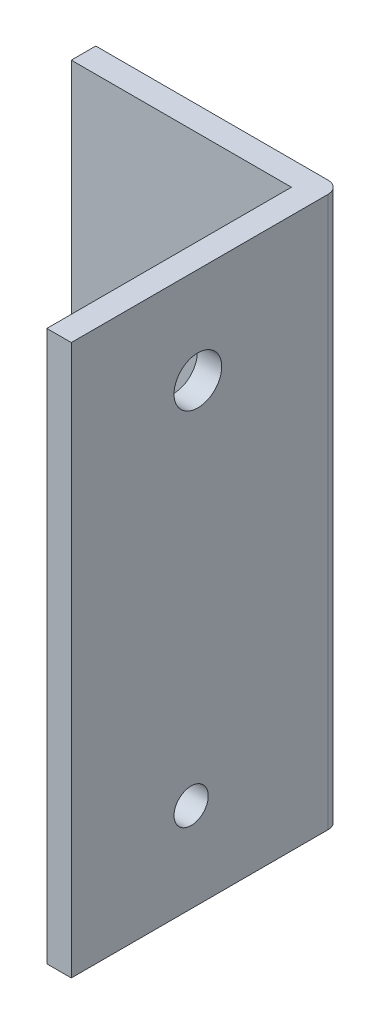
ISO-10303-21;
HEADER;
FILE_DESCRIPTION(('STEP AP214'),'2;1');
FILE_NAME('part.step','',(''),(''),'','','');
FILE_SCHEMA(('AUTOMOTIVE_DESIGN { 1 0 10303 214 1 1 1 1 }'));
ENDSEC;
DATA;
#1=APPLICATION_CONTEXT('core data for automotive mechanical design processes');
#2=APPLICATION_PROTOCOL_DEFINITION('international standard','automotive_design',2000,#1);
#3=PRODUCT_CONTEXT('',#1,'mechanical');
#4=PRODUCT('Part','Part','',(#3));
#5=PRODUCT_RELATED_PRODUCT_CATEGORY('part','',(#4));
#6=PRODUCT_DEFINITION_FORMATION('','',#4);
#7=PRODUCT_DEFINITION_CONTEXT('part definition',#1,'design');
#8=PRODUCT_DEFINITION('design','',#6,#7);
#9=PRODUCT_DEFINITION_SHAPE('','',#8);
#10=(LENGTH_UNIT() NAMED_UNIT(*) SI_UNIT(.MILLI.,.METRE.));
#11=(NAMED_UNIT(*) PLANE_ANGLE_UNIT() SI_UNIT($,.RADIAN.));
#12=(NAMED_UNIT(*) SI_UNIT($,.STERADIAN.) SOLID_ANGLE_UNIT());
#13=UNCERTAINTY_MEASURE_WITH_UNIT(LENGTH_MEASURE(1.E-05),#10,'distance_accuracy_value','');
#14=(GEOMETRIC_REPRESENTATION_CONTEXT(3) GLOBAL_UNCERTAINTY_ASSIGNED_CONTEXT((#13)) GLOBAL_UNIT_ASSIGNED_CONTEXT((#10,
#11,#12)) REPRESENTATION_CONTEXT('',''));
#15=CARTESIAN_POINT('',(0.,0.,0.));
#16=DIRECTION('',(0.,0.,1.));
#17=DIRECTION('',(1.,0.,0.));
#18=AXIS2_PLACEMENT_3D('',#15,#16,#17);
#19=CARTESIAN_POINT('',(25.4,-57.15,5.08));
#20=DIRECTION('',(-1.,0.,0.));
#21=DIRECTION('',(0.,0.,1.));
#22=AXIS2_PLACEMENT_3D('',#19,#20,#21);
#23=PLANE('',#22);
#24=CARTESIAN_POINT('',(25.4,37.211,29.591));
#25=DIRECTION('',(-1.,0.,0.));
#26=DIRECTION('',(0.,0.,1.));
#27=AXIS2_PLACEMENT_3D('',#24,#25,#26);
#28=CIRCLE('',#27,4.95299999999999);
#29=CARTESIAN_POINT('',(25.4,37.211,34.544));
#30=VERTEX_POINT('',#29);
#31=EDGE_CURVE('E120',#30,#30,#28,.T.);
#32=ORIENTED_EDGE('',*,*,#31,.T.);
#33=EDGE_LOOP('',(#32));
#34=FACE_BOUND('',#33,.T.);
#35=CARTESIAN_POINT('',(25.4,-38.608,30.988));
#36=DIRECTION('',(-1.,0.,0.));
#37=DIRECTION('',(0.,0.,1.));
#38=AXIS2_PLACEMENT_3D('',#35,#36,#37);
#39=CIRCLE('',#38,3.55600000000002);
#40=CARTESIAN_POINT('',(25.4,-38.608,34.544));
#41=VERTEX_POINT('',#40);
#42=EDGE_CURVE('E271',#41,#41,#39,.T.);
#43=ORIENTED_EDGE('',*,*,#42,.T.);
#44=EDGE_LOOP('',(#43));
#45=FACE_BOUND('',#44,.T.);
#46=DIRECTION('',(0.,0.,-1.));
#47=VECTOR('',#46,1.);
#48=CARTESIAN_POINT('',(25.4,-57.15,5.08));
#49=LINE('',#48,#47);
#50=CARTESIAN_POINT('',(25.4,-57.15,55.88));
#51=VERTEX_POINT('',#50);
#52=CARTESIAN_POINT('',(25.4,-57.15,2.54));
#53=VERTEX_POINT('',#52);
#54=EDGE_CURVE('E130',#51,#53,#49,.T.);
#55=ORIENTED_EDGE('',*,*,#54,.T.);
#56=DIRECTION('',(0.,1.,0.));
#57=VECTOR('',#56,1.);
#58=CARTESIAN_POINT('',(25.4,57.15,2.54));
#59=LINE('',#58,#57);
#60=CARTESIAN_POINT('',(25.4,57.15,2.54));
#61=VERTEX_POINT('',#60);
#62=EDGE_CURVE('E145',#53,#61,#59,.T.);
#63=ORIENTED_EDGE('',*,*,#62,.T.);
#64=DIRECTION('',(0.,0.,-1.));
#65=VECTOR('',#64,1.);
#66=CARTESIAN_POINT('',(25.4,57.15,5.08));
#67=LINE('',#66,#65);
#68=CARTESIAN_POINT('',(25.4,57.15,55.88));
#69=VERTEX_POINT('',#68);
#70=EDGE_CURVE('E143',#69,#61,#67,.T.);
#71=ORIENTED_EDGE('',*,*,#70,.F.);
#72=DIRECTION('',(0.,-1.,0.));
#73=VECTOR('',#72,1.);
#74=CARTESIAN_POINT('',(25.4,57.15,55.88));
#75=LINE('',#74,#73);
#76=EDGE_CURVE('E98',#69,#51,#75,.T.);
#77=ORIENTED_EDGE('',*,*,#76,.T.);
#78=EDGE_LOOP('',(#55,#63,#71,#77));
#79=FACE_BOUND('',#78,.T.);
#80=ADVANCED_FACE('F32',(#34,#45,#79),#23,.F.);
#81=CARTESIAN_POINT('',(-25.4,57.15,5.08));
#82=DIRECTION('',(0.,-1.,0.));
#83=DIRECTION('',(0.,0.,-1.));
#84=AXIS2_PLACEMENT_3D('',#81,#82,#83);
#85=PLANE('',#84);
#86=ORIENTED_EDGE('',*,*,#70,.T.);
#87=CARTESIAN_POINT('',(22.86,57.15,2.54));
#88=DIRECTION('',(0.,-1.,0.));
#89=DIRECTION('',(0.,0.,-1.));
#90=AXIS2_PLACEMENT_3D('',#87,#88,#89);
#91=CIRCLE('',#90,2.54);
#92=CARTESIAN_POINT('',(22.86,57.15,0.));
#93=VERTEX_POINT('',#92);
#94=EDGE_CURVE('E54',#61,#93,#91,.F.);
#95=ORIENTED_EDGE('',*,*,#94,.T.);
#96=DIRECTION('',(-1.,0.,0.));
#97=VECTOR('',#96,1.);
#98=CARTESIAN_POINT('',(-25.4,57.15,0.));
#99=LINE('',#98,#97);
#100=CARTESIAN_POINT('',(-25.4,57.15,0.));
#101=VERTEX_POINT('',#100);
#102=EDGE_CURVE('E121',#93,#101,#99,.T.);
#103=ORIENTED_EDGE('',*,*,#102,.T.);
#104=DIRECTION('',(0.,0.,-1.));
#105=VECTOR('',#104,1.);
#106=CARTESIAN_POINT('',(-25.4,57.15,5.08));
#107=LINE('',#106,#105);
#108=CARTESIAN_POINT('',(-25.4,57.15,5.08));
#109=VERTEX_POINT('',#108);
#110=EDGE_CURVE('E140',#109,#101,#107,.T.);
#111=ORIENTED_EDGE('',*,*,#110,.F.);
#112=DIRECTION('',(-1.,0.,0.));
#113=VECTOR('',#112,1.);
#114=CARTESIAN_POINT('',(-25.4,57.15,5.08));
#115=LINE('',#114,#113);
#116=CARTESIAN_POINT('',(20.32,57.15,5.08));
#117=VERTEX_POINT('',#116);
#118=EDGE_CURVE('E112',#117,#109,#115,.T.);
#119=ORIENTED_EDGE('',*,*,#118,.F.);
#120=DIRECTION('',(0.,0.,1.));
#121=VECTOR('',#120,1.);
#122=CARTESIAN_POINT('',(20.32,57.15,5.08));
#123=LINE('',#122,#121);
#124=CARTESIAN_POINT('',(20.32,57.15,55.88));
#125=VERTEX_POINT('',#124);
#126=EDGE_CURVE('E105',#117,#125,#123,.T.);
#127=ORIENTED_EDGE('',*,*,#126,.T.);
#128=DIRECTION('',(1.,0.,0.));
#129=VECTOR('',#128,1.);
#130=CARTESIAN_POINT('',(20.32,57.15,55.88));
#131=LINE('',#130,#129);
#132=EDGE_CURVE('E91',#125,#69,#131,.T.);
#133=ORIENTED_EDGE('',*,*,#132,.T.);
#134=EDGE_LOOP('',(#86,#95,#103,#111,#119,#127,#133));
#135=FACE_BOUND('',#134,.T.);
#136=ADVANCED_FACE('F110',(#135),#85,.F.);
#137=CARTESIAN_POINT('',(-25.4,-57.15,5.08));
#138=DIRECTION('',(1.,0.,0.));
#139=DIRECTION('',(0.,0.,-1.));
#140=AXIS2_PLACEMENT_3D('',#137,#138,#139);
#141=PLANE('',#140);
#142=DIRECTION('',(0.,-1.,0.));
#143=VECTOR('',#142,1.);
#144=CARTESIAN_POINT('',(-25.4,-57.15,0.));
#145=LINE('',#144,#143);
#146=CARTESIAN_POINT('',(-25.4,-57.15,0.));
#147=VERTEX_POINT('',#146);
#148=EDGE_CURVE('E132',#101,#147,#145,.T.);
#149=ORIENTED_EDGE('',*,*,#148,.T.);
#150=DIRECTION('',(0.,0.,-1.));
#151=VECTOR('',#150,1.);
#152=CARTESIAN_POINT('',(-25.4,-57.15,5.08));
#153=LINE('',#152,#151);
#154=CARTESIAN_POINT('',(-25.4,-57.15,5.08));
#155=VERTEX_POINT('',#154);
#156=EDGE_CURVE('E137',#155,#147,#153,.T.);
#157=ORIENTED_EDGE('',*,*,#156,.F.);
#158=DIRECTION('',(0.,-1.,0.));
#159=VECTOR('',#158,1.);
#160=CARTESIAN_POINT('',(-25.4,-57.15,5.08));
#161=LINE('',#160,#159);
#162=EDGE_CURVE('E124',#109,#155,#161,.T.);
#163=ORIENTED_EDGE('',*,*,#162,.F.);
#164=ORIENTED_EDGE('',*,*,#110,.T.);
#165=EDGE_LOOP('',(#149,#157,#163,#164));
#166=FACE_BOUND('',#165,.T.);
#167=ADVANCED_FACE('F159',(#166),#141,.F.);
#168=CARTESIAN_POINT('',(-25.4,-57.15,5.08));
#169=DIRECTION('',(0.,1.,0.));
#170=DIRECTION('',(0.,0.,1.));
#171=AXIS2_PLACEMENT_3D('',#168,#169,#170);
#172=PLANE('',#171);
#173=DIRECTION('',(1.,0.,0.));
#174=VECTOR('',#173,1.);
#175=CARTESIAN_POINT('',(-25.4,-57.15,0.));
#176=LINE('',#175,#174);
#177=CARTESIAN_POINT('',(22.86,-57.15,0.));
#178=VERTEX_POINT('',#177);
#179=EDGE_CURVE('E125',#147,#178,#176,.T.);
#180=ORIENTED_EDGE('',*,*,#179,.T.);
#181=CARTESIAN_POINT('',(22.86,-57.15,2.54));
#182=DIRECTION('',(0.,1.,0.));
#183=DIRECTION('',(0.,0.,1.));
#184=AXIS2_PLACEMENT_3D('',#181,#182,#183);
#185=CIRCLE('',#184,2.54);
#186=EDGE_CURVE('E11',#178,#53,#185,.F.);
#187=ORIENTED_EDGE('',*,*,#186,.T.);
#188=ORIENTED_EDGE('',*,*,#54,.F.);
#189=DIRECTION('',(1.,0.,0.));
#190=VECTOR('',#189,1.);
#191=CARTESIAN_POINT('',(20.32,-57.15,55.88));
#192=LINE('',#191,#190);
#193=CARTESIAN_POINT('',(20.32,-57.15,55.88));
#194=VERTEX_POINT('',#193);
#195=EDGE_CURVE('E100',#194,#51,#192,.T.);
#196=ORIENTED_EDGE('',*,*,#195,.F.);
#197=DIRECTION('',(0.,0.,-1.));
#198=VECTOR('',#197,1.);
#199=CARTESIAN_POINT('',(20.32,-57.15,55.88));
#200=LINE('',#199,#198);
#201=CARTESIAN_POINT('',(20.32,-57.15,5.08));
#202=VERTEX_POINT('',#201);
#203=EDGE_CURVE('E101',#194,#202,#200,.T.);
#204=ORIENTED_EDGE('',*,*,#203,.T.);
#205=DIRECTION('',(1.,0.,0.));
#206=VECTOR('',#205,1.);
#207=CARTESIAN_POINT('',(-25.4,-57.15,5.08));
#208=LINE('',#207,#206);
#209=EDGE_CURVE('E127',#155,#202,#208,.T.);
#210=ORIENTED_EDGE('',*,*,#209,.F.);
#211=ORIENTED_EDGE('',*,*,#156,.T.);
#212=EDGE_LOOP('',(#180,#187,#188,#196,#204,#210,#211));
#213=FACE_BOUND('',#212,.T.);
#214=ADVANCED_FACE('F153',(#213),#172,.F.);
#215=CARTESIAN_POINT('',(0.,0.,5.08));
#216=DIRECTION('',(0.,0.,-1.));
#217=DIRECTION('',(-1.,0.,0.));
#218=AXIS2_PLACEMENT_3D('',#215,#216,#217);
#219=PLANE('',#218);
#220=ORIENTED_EDGE('',*,*,#209,.T.);
#221=DIRECTION('',(0.,1.,0.));
#222=VECTOR('',#221,1.);
#223=CARTESIAN_POINT('',(20.32,-57.15,5.08));
#224=LINE('',#223,#222);
#225=EDGE_CURVE('E113',#202,#117,#224,.T.);
#226=ORIENTED_EDGE('',*,*,#225,.T.);
#227=ORIENTED_EDGE('',*,*,#118,.T.);
#228=ORIENTED_EDGE('',*,*,#162,.T.);
#229=EDGE_LOOP('',(#220,#226,#227,#228));
#230=FACE_BOUND('',#229,.T.);
#231=ADVANCED_FACE('F162',(#230),#219,.F.);
#232=CARTESIAN_POINT('',(0.,0.,0.));
#233=DIRECTION('',(0.,0.,-1.));
#234=DIRECTION('',(-1.,0.,0.));
#235=AXIS2_PLACEMENT_3D('',#232,#233,#234);
#236=PLANE('',#235);
#237=ORIENTED_EDGE('',*,*,#102,.F.);
#238=DIRECTION('',(0.,1.,0.));
#239=VECTOR('',#238,1.);
#240=CARTESIAN_POINT('',(22.86,-57.15,0.));
#241=LINE('',#240,#239);
#242=EDGE_CURVE('E40',#93,#178,#241,.F.);
#243=ORIENTED_EDGE('',*,*,#242,.T.);
#244=ORIENTED_EDGE('',*,*,#179,.F.);
#245=ORIENTED_EDGE('',*,*,#148,.F.);
#246=EDGE_LOOP('',(#237,#243,#244,#245));
#247=FACE_BOUND('',#246,.T.);
#248=ADVANCED_FACE('F157',(#247),#236,.T.);
#249=CARTESIAN_POINT('',(20.32,57.15,55.88));
#250=DIRECTION('',(0.,0.,1.));
#251=DIRECTION('',(0.,-1.,0.));
#252=AXIS2_PLACEMENT_3D('',#249,#250,#251);
#253=PLANE('',#252);
#254=ORIENTED_EDGE('',*,*,#76,.F.);
#255=ORIENTED_EDGE('',*,*,#132,.F.);
#256=DIRECTION('',(0.,-1.,0.));
#257=VECTOR('',#256,1.);
#258=CARTESIAN_POINT('',(20.32,57.15,55.88));
#259=LINE('',#258,#257);
#260=EDGE_CURVE('E95',#125,#194,#259,.T.);
#261=ORIENTED_EDGE('',*,*,#260,.T.);
#262=ORIENTED_EDGE('',*,*,#195,.T.);
#263=EDGE_LOOP('',(#254,#255,#261,#262));
#264=FACE_BOUND('',#263,.T.);
#265=ADVANCED_FACE('F93',(#264),#253,.T.);
#266=CARTESIAN_POINT('',(20.32,0.,0.));
#267=DIRECTION('',(1.,0.,0.));
#268=DIRECTION('',(0.,0.,-1.));
#269=AXIS2_PLACEMENT_3D('',#266,#267,#268);
#270=PLANE('',#269);
#271=CARTESIAN_POINT('',(20.32,37.211,29.591));
#272=DIRECTION('',(-1.,0.,0.));
#273=DIRECTION('',(0.,0.,1.));
#274=AXIS2_PLACEMENT_3D('',#271,#272,#273);
#275=CIRCLE('',#274,4.95299999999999);
#276=CARTESIAN_POINT('',(20.32,37.211,34.544));
#277=VERTEX_POINT('',#276);
#278=EDGE_CURVE('E270',#277,#277,#275,.T.);
#279=ORIENTED_EDGE('',*,*,#278,.F.);
#280=EDGE_LOOP('',(#279));
#281=FACE_BOUND('',#280,.T.);
#282=CARTESIAN_POINT('',(20.32,-38.608,30.988));
#283=DIRECTION('',(-1.,0.,0.));
#284=DIRECTION('',(0.,0.,1.));
#285=AXIS2_PLACEMENT_3D('',#282,#283,#284);
#286=CIRCLE('',#285,3.55600000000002);
#287=CARTESIAN_POINT('',(20.32,-38.608,34.544));
#288=VERTEX_POINT('',#287);
#289=EDGE_CURVE('E275',#288,#288,#286,.T.);
#290=ORIENTED_EDGE('',*,*,#289,.F.);
#291=EDGE_LOOP('',(#290));
#292=FACE_BOUND('',#291,.T.);
#293=ORIENTED_EDGE('',*,*,#225,.F.);
#294=ORIENTED_EDGE('',*,*,#203,.F.);
#295=ORIENTED_EDGE('',*,*,#260,.F.);
#296=ORIENTED_EDGE('',*,*,#126,.F.);
#297=EDGE_LOOP('',(#293,#294,#295,#296));
#298=FACE_BOUND('',#297,.T.);
#299=ADVANCED_FACE('F104',(#281,#292,#298),#270,.F.);
#300=CARTESIAN_POINT('',(22.86,-57.15,2.54));
#301=DIRECTION('',(0.,-1.,0.));
#302=DIRECTION('',(0.,0.,-1.));
#303=AXIS2_PLACEMENT_3D('',#300,#301,#302);
#304=CYLINDRICAL_SURFACE('',#303,2.54);
#305=ORIENTED_EDGE('',*,*,#186,.F.);
#306=ORIENTED_EDGE('',*,*,#242,.F.);
#307=ORIENTED_EDGE('',*,*,#94,.F.);
#308=ORIENTED_EDGE('',*,*,#62,.F.);
#309=EDGE_LOOP('',(#305,#306,#307,#308));
#310=FACE_BOUND('',#309,.T.);
#311=ADVANCED_FACE('F34',(#310),#304,.T.);
#312=CARTESIAN_POINT('',(25.4,-38.608,30.988));
#313=DIRECTION('',(-1.,0.,0.));
#314=DIRECTION('',(0.,0.,1.));
#315=AXIS2_PLACEMENT_3D('',#312,#313,#314);
#316=CYLINDRICAL_SURFACE('',#315,3.55600000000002);
#317=ORIENTED_EDGE('',*,*,#42,.F.);
#318=EDGE_LOOP('',(#317));
#319=FACE_BOUND('',#318,.T.);
#320=ORIENTED_EDGE('',*,*,#289,.T.);
#321=EDGE_LOOP('',(#320));
#322=FACE_BOUND('',#321,.T.);
#323=ADVANCED_FACE('F212',(#319,#322),#316,.F.);
#324=CARTESIAN_POINT('',(25.4,37.211,29.591));
#325=DIRECTION('',(-1.,0.,0.));
#326=DIRECTION('',(0.,0.,1.));
#327=AXIS2_PLACEMENT_3D('',#324,#325,#326);
#328=CYLINDRICAL_SURFACE('',#327,4.95299999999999);
#329=ORIENTED_EDGE('',*,*,#31,.F.);
#330=EDGE_LOOP('',(#329));
#331=FACE_BOUND('',#330,.T.);
#332=ORIENTED_EDGE('',*,*,#278,.T.);
#333=EDGE_LOOP('',(#332));
#334=FACE_BOUND('',#333,.T.);
#335=ADVANCED_FACE('F234',(#331,#334),#328,.F.);
#336=CLOSED_SHELL('',(#80,#136,#167,#214,#231,#248,#265,#299,#311,#323,#335));
#337=MANIFOLD_SOLID_BREP('B2',#336);
#338=ADVANCED_BREP_SHAPE_REPRESENTATION('',(#18,#337),#14);
#339=SHAPE_DEFINITION_REPRESENTATION(#9,#338);
ENDSEC;
END-ISO-10303-21;
